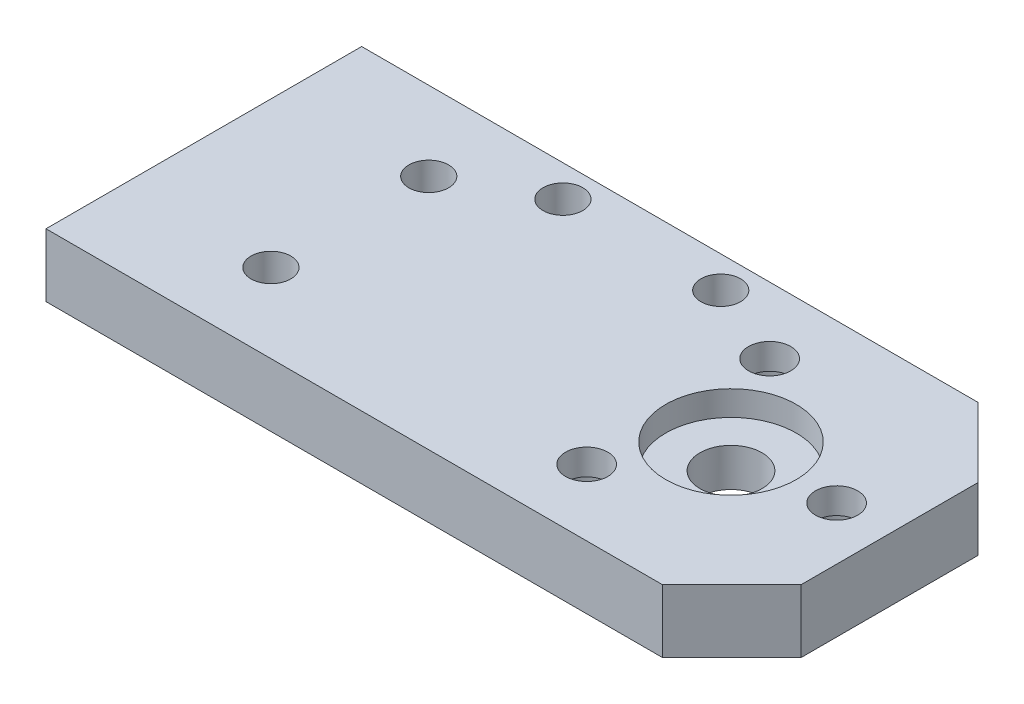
ISO-10303-21;
HEADER;
FILE_DESCRIPTION(('STEP AP214'),'2;1');
FILE_NAME('part.step','',(''),(''),'','','');
FILE_SCHEMA(('AUTOMOTIVE_DESIGN { 1 0 10303 214 1 1 1 1 }'));
ENDSEC;
DATA;
#1=APPLICATION_CONTEXT('core data for automotive mechanical design processes');
#2=APPLICATION_PROTOCOL_DEFINITION('international standard','automotive_design',2000,#1);
#3=PRODUCT_CONTEXT('',#1,'mechanical');
#4=PRODUCT('Part','Part','',(#3));
#5=PRODUCT_RELATED_PRODUCT_CATEGORY('part','',(#4));
#6=PRODUCT_DEFINITION_FORMATION('','',#4);
#7=PRODUCT_DEFINITION_CONTEXT('part definition',#1,'design');
#8=PRODUCT_DEFINITION('design','',#6,#7);
#9=PRODUCT_DEFINITION_SHAPE('','',#8);
#10=(LENGTH_UNIT() NAMED_UNIT(*) SI_UNIT(.MILLI.,.METRE.));
#11=(NAMED_UNIT(*) PLANE_ANGLE_UNIT() SI_UNIT($,.RADIAN.));
#12=(NAMED_UNIT(*) SI_UNIT($,.STERADIAN.) SOLID_ANGLE_UNIT());
#13=UNCERTAINTY_MEASURE_WITH_UNIT(LENGTH_MEASURE(1.E-05),#10,'distance_accuracy_value','');
#14=(GEOMETRIC_REPRESENTATION_CONTEXT(3) GLOBAL_UNCERTAINTY_ASSIGNED_CONTEXT((#13)) GLOBAL_UNIT_ASSIGNED_CONTEXT((#10,
#11,#12)) REPRESENTATION_CONTEXT('',''));
#15=CARTESIAN_POINT('',(0.,0.,0.));
#16=DIRECTION('',(0.,0.,1.));
#17=DIRECTION('',(1.,0.,0.));
#18=AXIS2_PLACEMENT_3D('',#15,#16,#17);
#19=CARTESIAN_POINT('',(42.4175,-0.92,-12.7));
#20=DIRECTION('',(0.,1.,0.));
#21=DIRECTION('',(0.,0.,1.));
#22=AXIS2_PLACEMENT_3D('',#19,#20,#21);
#23=CYLINDRICAL_SURFACE('',#22,2.5);
#24=CARTESIAN_POINT('',(42.4175,0.,-12.7));
#25=DIRECTION('',(0.,-1.,0.));
#26=DIRECTION('',(0.,0.,-1.));
#27=AXIS2_PLACEMENT_3D('',#24,#25,#26);
#28=CIRCLE('',#27,2.5);
#29=CARTESIAN_POINT('',(42.4175,0.,-15.2));
#30=VERTEX_POINT('',#29);
#31=EDGE_CURVE('E122',#30,#30,#28,.T.);
#32=ORIENTED_EDGE('',*,*,#31,.T.);
#33=EDGE_LOOP('',(#32));
#34=FACE_BOUND('',#33,.T.);
#35=CARTESIAN_POINT('',(42.4175,3.08,-12.7));
#36=DIRECTION('',(0.,1.,0.));
#37=DIRECTION('',(0.,0.,1.));
#38=AXIS2_PLACEMENT_3D('',#35,#36,#37);
#39=CIRCLE('',#38,2.5);
#40=CARTESIAN_POINT('',(42.4175,3.08,-10.2));
#41=VERTEX_POINT('',#40);
#42=EDGE_CURVE('E125',#41,#41,#39,.F.);
#43=ORIENTED_EDGE('',*,*,#42,.F.);
#44=EDGE_LOOP('',(#43));
#45=FACE_BOUND('',#44,.T.);
#46=ADVANCED_FACE('F38',(#34,#45),#23,.F.);
#47=CARTESIAN_POINT('',(0.,5.08,0.));
#48=DIRECTION('',(1.,0.,0.));
#49=DIRECTION('',(0.,0.,-1.));
#50=AXIS2_PLACEMENT_3D('',#47,#48,#49);
#51=PLANE('',#50);
#52=DIRECTION('',(0.,0.,1.));
#53=VECTOR('',#52,1.);
#54=CARTESIAN_POINT('',(0.,0.,0.));
#55=LINE('',#54,#53);
#56=CARTESIAN_POINT('',(0.,0.,-25.4));
#57=VERTEX_POINT('',#56);
#58=CARTESIAN_POINT('',(0.,0.,0.));
#59=VERTEX_POINT('',#58);
#60=EDGE_CURVE('E113',#57,#59,#55,.T.);
#61=ORIENTED_EDGE('',*,*,#60,.T.);
#62=DIRECTION('',(0.,-1.,0.));
#63=VECTOR('',#62,1.);
#64=CARTESIAN_POINT('',(0.,5.08,0.));
#65=LINE('',#64,#63);
#66=CARTESIAN_POINT('',(0.,5.08,0.));
#67=VERTEX_POINT('',#66);
#68=EDGE_CURVE('E96',#67,#59,#65,.T.);
#69=ORIENTED_EDGE('',*,*,#68,.F.);
#70=DIRECTION('',(0.,0.,1.));
#71=VECTOR('',#70,1.);
#72=CARTESIAN_POINT('',(0.,5.08,0.));
#73=LINE('',#72,#71);
#74=CARTESIAN_POINT('',(0.,5.08,-25.4));
#75=VERTEX_POINT('',#74);
#76=EDGE_CURVE('E101',#75,#67,#73,.T.);
#77=ORIENTED_EDGE('',*,*,#76,.F.);
#78=DIRECTION('',(0.,-1.,0.));
#79=VECTOR('',#78,1.);
#80=CARTESIAN_POINT('',(0.,5.08,-25.4));
#81=LINE('',#80,#79);
#82=EDGE_CURVE('E115',#75,#57,#81,.T.);
#83=ORIENTED_EDGE('',*,*,#82,.T.);
#84=EDGE_LOOP('',(#61,#69,#77,#83));
#85=FACE_BOUND('',#84,.T.);
#86=ADVANCED_FACE('F111',(#85),#51,.F.);
#87=CARTESIAN_POINT('',(0.,5.08,0.));
#88=DIRECTION('',(0.,0.,-1.));
#89=DIRECTION('',(-1.,0.,0.));
#90=AXIS2_PLACEMENT_3D('',#87,#88,#89);
#91=PLANE('',#90);
#92=DIRECTION('',(1.,0.,0.));
#93=VECTOR('',#92,1.);
#94=CARTESIAN_POINT('',(0.,0.,0.));
#95=LINE('',#94,#93);
#96=CARTESIAN_POINT('',(49.5935,0.,0.));
#97=VERTEX_POINT('',#96);
#98=EDGE_CURVE('E164',#59,#97,#95,.T.);
#99=ORIENTED_EDGE('',*,*,#98,.T.);
#100=DIRECTION('',(0.,1.,0.));
#101=VECTOR('',#100,1.);
#102=CARTESIAN_POINT('',(49.5935,5.08,0.));
#103=LINE('',#102,#101);
#104=CARTESIAN_POINT('',(49.5935,5.08,0.));
#105=VERTEX_POINT('',#104);
#106=EDGE_CURVE('E62',#97,#105,#103,.T.);
#107=ORIENTED_EDGE('',*,*,#106,.T.);
#108=DIRECTION('',(1.,0.,0.));
#109=VECTOR('',#108,1.);
#110=CARTESIAN_POINT('',(0.,5.08,0.));
#111=LINE('',#110,#109);
#112=EDGE_CURVE('E92',#67,#105,#111,.T.);
#113=ORIENTED_EDGE('',*,*,#112,.F.);
#114=ORIENTED_EDGE('',*,*,#68,.T.);
#115=EDGE_LOOP('',(#99,#107,#113,#114));
#116=FACE_BOUND('',#115,.T.);
#117=ADVANCED_FACE('F94',(#116),#91,.F.);
#118=CARTESIAN_POINT('',(55.1815,5.08,0.));
#119=DIRECTION('',(-1.,0.,0.));
#120=DIRECTION('',(0.,0.,1.));
#121=AXIS2_PLACEMENT_3D('',#118,#119,#120);
#122=PLANE('',#121);
#123=DIRECTION('',(0.,0.,-1.));
#124=VECTOR('',#123,1.);
#125=CARTESIAN_POINT('',(55.1815,5.08,0.));
#126=LINE('',#125,#124);
#127=CARTESIAN_POINT('',(55.1815,5.08,-5.58800000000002));
#128=VERTEX_POINT('',#127);
#129=CARTESIAN_POINT('',(55.1815,5.08,-19.812));
#130=VERTEX_POINT('',#129);
#131=EDGE_CURVE('E100',#128,#130,#126,.T.);
#132=ORIENTED_EDGE('',*,*,#131,.F.);
#133=DIRECTION('',(0.,-1.,0.));
#134=VECTOR('',#133,1.);
#135=CARTESIAN_POINT('',(55.1815,5.08,-5.58800000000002));
#136=LINE('',#135,#134);
#137=CARTESIAN_POINT('',(55.1815,0.,-5.58800000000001));
#138=VERTEX_POINT('',#137);
#139=EDGE_CURVE('E117',#128,#138,#136,.T.);
#140=ORIENTED_EDGE('',*,*,#139,.T.);
#141=DIRECTION('',(0.,0.,-1.));
#142=VECTOR('',#141,1.);
#143=CARTESIAN_POINT('',(55.1815,0.,0.));
#144=LINE('',#143,#142);
#145=CARTESIAN_POINT('',(55.1815,0.,-19.812));
#146=VERTEX_POINT('',#145);
#147=EDGE_CURVE('E165',#138,#146,#144,.T.);
#148=ORIENTED_EDGE('',*,*,#147,.T.);
#149=DIRECTION('',(0.,1.,0.));
#150=VECTOR('',#149,1.);
#151=CARTESIAN_POINT('',(55.1815,5.08,-19.812));
#152=LINE('',#151,#150);
#153=EDGE_CURVE('E114',#146,#130,#152,.T.);
#154=ORIENTED_EDGE('',*,*,#153,.T.);
#155=EDGE_LOOP('',(#132,#140,#148,#154));
#156=FACE_BOUND('',#155,.T.);
#157=ADVANCED_FACE('F156',(#156),#122,.F.);
#158=CARTESIAN_POINT('',(0.,5.08,-25.4));
#159=DIRECTION('',(0.,0.,1.));
#160=DIRECTION('',(1.,0.,0.));
#161=AXIS2_PLACEMENT_3D('',#158,#159,#160);
#162=PLANE('',#161);
#163=DIRECTION('',(-1.,0.,0.));
#164=VECTOR('',#163,1.);
#165=CARTESIAN_POINT('',(0.,5.08,-25.4));
#166=LINE('',#165,#164);
#167=CARTESIAN_POINT('',(49.5935,5.08,-25.4));
#168=VERTEX_POINT('',#167);
#169=EDGE_CURVE('E105',#168,#75,#166,.T.);
#170=ORIENTED_EDGE('',*,*,#169,.F.);
#171=DIRECTION('',(0.,-1.,0.));
#172=VECTOR('',#171,1.);
#173=CARTESIAN_POINT('',(49.5935,5.08,-25.4));
#174=LINE('',#173,#172);
#175=CARTESIAN_POINT('',(49.5935,0.,-25.4));
#176=VERTEX_POINT('',#175);
#177=EDGE_CURVE('E11',#168,#176,#174,.T.);
#178=ORIENTED_EDGE('',*,*,#177,.T.);
#179=DIRECTION('',(-1.,0.,0.));
#180=VECTOR('',#179,1.);
#181=CARTESIAN_POINT('',(0.,0.,-25.4));
#182=LINE('',#181,#180);
#183=EDGE_CURVE('E109',#176,#57,#182,.T.);
#184=ORIENTED_EDGE('',*,*,#183,.T.);
#185=ORIENTED_EDGE('',*,*,#82,.F.);
#186=EDGE_LOOP('',(#170,#178,#184,#185));
#187=FACE_BOUND('',#186,.T.);
#188=ADVANCED_FACE('F175',(#187),#162,.F.);
#189=CARTESIAN_POINT('',(0.,5.08,0.));
#190=DIRECTION('',(0.,-1.,0.));
#191=DIRECTION('',(0.,0.,-1.));
#192=AXIS2_PLACEMENT_3D('',#189,#190,#191);
#193=PLANE('',#192);
#194=CARTESIAN_POINT('',(31.4325,5.08,-22.86));
#195=DIRECTION('',(0.,1.,0.));
#196=DIRECTION('',(0.,0.,1.));
#197=AXIS2_PLACEMENT_3D('',#194,#195,#196);
#198=CIRCLE('',#197,1.6);
#199=CARTESIAN_POINT('',(31.4325,5.08,-21.26));
#200=VERTEX_POINT('',#199);
#201=EDGE_CURVE('E374',#200,#200,#198,.T.);
#202=ORIENTED_EDGE('',*,*,#201,.F.);
#203=EDGE_LOOP('',(#202));
#204=FACE_BOUND('',#203,.T.);
#205=CARTESIAN_POINT('',(18.7325,5.08,-22.86));
#206=DIRECTION('',(0.,1.,0.));
#207=DIRECTION('',(0.,0.,1.));
#208=AXIS2_PLACEMENT_3D('',#205,#206,#207);
#209=CIRCLE('',#208,1.6);
#210=CARTESIAN_POINT('',(18.7325,5.08,-21.26));
#211=VERTEX_POINT('',#210);
#212=EDGE_CURVE('E376',#211,#211,#209,.T.);
#213=ORIENTED_EDGE('',*,*,#212,.F.);
#214=EDGE_LOOP('',(#213));
#215=FACE_BOUND('',#214,.T.);
#216=CARTESIAN_POINT('',(11.7475,5.08,-19.05));
#217=DIRECTION('',(0.,1.,0.));
#218=DIRECTION('',(0.,0.,1.));
#219=AXIS2_PLACEMENT_3D('',#216,#217,#218);
#220=CIRCLE('',#219,1.6);
#221=CARTESIAN_POINT('',(11.7475,5.08,-17.45));
#222=VERTEX_POINT('',#221);
#223=EDGE_CURVE('E383',#222,#222,#220,.T.);
#224=ORIENTED_EDGE('',*,*,#223,.F.);
#225=EDGE_LOOP('',(#224));
#226=FACE_BOUND('',#225,.T.);
#227=CARTESIAN_POINT('',(11.7475,5.08,-6.35));
#228=DIRECTION('',(0.,1.,0.));
#229=DIRECTION('',(0.,0.,1.));
#230=AXIS2_PLACEMENT_3D('',#227,#228,#229);
#231=CIRCLE('',#230,1.6);
#232=CARTESIAN_POINT('',(11.7475,5.08,-4.75));
#233=VERTEX_POINT('',#232);
#234=EDGE_CURVE('E389',#233,#233,#231,.T.);
#235=ORIENTED_EDGE('',*,*,#234,.F.);
#236=EDGE_LOOP('',(#235));
#237=FACE_BOUND('',#236,.T.);
#238=CARTESIAN_POINT('',(50.9175,5.08,-12.7));
#239=DIRECTION('',(0.,-1.,0.));
#240=DIRECTION('',(0.,0.,-1.));
#241=AXIS2_PLACEMENT_3D('',#238,#239,#240);
#242=CIRCLE('',#241,1.7);
#243=CARTESIAN_POINT('',(50.9175,5.08,-14.4));
#244=VERTEX_POINT('',#243);
#245=EDGE_CURVE('E139',#244,#244,#242,.T.);
#246=ORIENTED_EDGE('',*,*,#245,.T.);
#247=EDGE_LOOP('',(#246));
#248=FACE_BOUND('',#247,.T.);
#249=CARTESIAN_POINT('',(38.1675,5.08,-5.33878406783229));
#250=DIRECTION('',(0.,-1.,0.));
#251=DIRECTION('',(0.,0.,-1.));
#252=AXIS2_PLACEMENT_3D('',#249,#250,#251);
#253=CIRCLE('',#252,1.7);
#254=CARTESIAN_POINT('',(38.1675,5.08,-7.03878406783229));
#255=VERTEX_POINT('',#254);
#256=EDGE_CURVE('E134',#255,#255,#253,.T.);
#257=ORIENTED_EDGE('',*,*,#256,.T.);
#258=EDGE_LOOP('',(#257));
#259=FACE_BOUND('',#258,.T.);
#260=CARTESIAN_POINT('',(38.1675,5.08,-20.0612159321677));
#261=DIRECTION('',(0.,-1.,0.));
#262=DIRECTION('',(0.,0.,-1.));
#263=AXIS2_PLACEMENT_3D('',#260,#261,#262);
#264=CIRCLE('',#263,1.7);
#265=CARTESIAN_POINT('',(38.1675,5.08,-21.7612159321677));
#266=VERTEX_POINT('',#265);
#267=EDGE_CURVE('E129',#266,#266,#264,.T.);
#268=ORIENTED_EDGE('',*,*,#267,.T.);
#269=EDGE_LOOP('',(#268));
#270=FACE_BOUND('',#269,.T.);
#271=CARTESIAN_POINT('',(42.4175,5.08,-12.7));
#272=DIRECTION('',(0.,1.,0.));
#273=DIRECTION('',(0.,0.,1.));
#274=AXIS2_PLACEMENT_3D('',#271,#272,#273);
#275=CIRCLE('',#274,5.25);
#276=CARTESIAN_POINT('',(42.4175,5.08,-7.45));
#277=VERTEX_POINT('',#276);
#278=EDGE_CURVE('E132',#277,#277,#275,.T.);
#279=ORIENTED_EDGE('',*,*,#278,.F.);
#280=EDGE_LOOP('',(#279));
#281=FACE_BOUND('',#280,.T.);
#282=ORIENTED_EDGE('',*,*,#112,.T.);
#283=DIRECTION('',(-0.707106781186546,0.,0.707106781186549));
#284=VECTOR('',#283,1.);
#285=CARTESIAN_POINT('',(55.1815,5.08,-5.58800000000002));
#286=LINE('',#285,#284);
#287=EDGE_CURVE('E47',#105,#128,#286,.F.);
#288=ORIENTED_EDGE('',*,*,#287,.T.);
#289=ORIENTED_EDGE('',*,*,#131,.T.);
#290=DIRECTION('',(0.707106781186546,0.,0.707106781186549));
#291=VECTOR('',#290,1.);
#292=CARTESIAN_POINT('',(49.5935,5.08,-25.4));
#293=LINE('',#292,#291);
#294=EDGE_CURVE('E54',#130,#168,#293,.F.);
#295=ORIENTED_EDGE('',*,*,#294,.T.);
#296=ORIENTED_EDGE('',*,*,#169,.T.);
#297=ORIENTED_EDGE('',*,*,#76,.T.);
#298=EDGE_LOOP('',(#282,#288,#289,#295,#296,#297));
#299=FACE_BOUND('',#298,.T.);
#300=ADVANCED_FACE('F104',(#204,#215,#226,#237,#248,#259,#270,#281,#299),#193,.F.);
#301=CARTESIAN_POINT('',(0.,0.,0.));
#302=DIRECTION('',(0.,-1.,0.));
#303=DIRECTION('',(0.,0.,-1.));
#304=AXIS2_PLACEMENT_3D('',#301,#302,#303);
#305=PLANE('',#304);
#306=CARTESIAN_POINT('',(31.4325,0.,-22.86));
#307=DIRECTION('',(0.,-1.,0.));
#308=DIRECTION('',(0.,0.,-1.));
#309=AXIS2_PLACEMENT_3D('',#306,#307,#308);
#310=CIRCLE('',#309,1.6);
#311=CARTESIAN_POINT('',(31.4325,0.,-24.46));
#312=VERTEX_POINT('',#311);
#313=EDGE_CURVE('E42',#312,#312,#310,.T.);
#314=ORIENTED_EDGE('',*,*,#313,.F.);
#315=EDGE_LOOP('',(#314));
#316=FACE_BOUND('',#315,.T.);
#317=CARTESIAN_POINT('',(18.7325,0.,-22.86));
#318=DIRECTION('',(0.,-1.,0.));
#319=DIRECTION('',(0.,0.,-1.));
#320=AXIS2_PLACEMENT_3D('',#317,#318,#319);
#321=CIRCLE('',#320,1.6);
#322=CARTESIAN_POINT('',(18.7325,0.,-24.46));
#323=VERTEX_POINT('',#322);
#324=EDGE_CURVE('E380',#323,#323,#321,.T.);
#325=ORIENTED_EDGE('',*,*,#324,.F.);
#326=EDGE_LOOP('',(#325));
#327=FACE_BOUND('',#326,.T.);
#328=CARTESIAN_POINT('',(11.7475,0.,-19.05));
#329=DIRECTION('',(0.,-1.,0.));
#330=DIRECTION('',(0.,0.,-1.));
#331=AXIS2_PLACEMENT_3D('',#328,#329,#330);
#332=CIRCLE('',#331,1.6);
#333=CARTESIAN_POINT('',(11.7475,0.,-20.65));
#334=VERTEX_POINT('',#333);
#335=EDGE_CURVE('E386',#334,#334,#332,.T.);
#336=ORIENTED_EDGE('',*,*,#335,.F.);
#337=EDGE_LOOP('',(#336));
#338=FACE_BOUND('',#337,.T.);
#339=CARTESIAN_POINT('',(11.7475,0.,-6.35));
#340=DIRECTION('',(0.,-1.,0.));
#341=DIRECTION('',(0.,0.,-1.));
#342=AXIS2_PLACEMENT_3D('',#339,#340,#341);
#343=CIRCLE('',#342,1.6);
#344=CARTESIAN_POINT('',(11.7475,0.,-7.95));
#345=VERTEX_POINT('',#344);
#346=EDGE_CURVE('E392',#345,#345,#343,.T.);
#347=ORIENTED_EDGE('',*,*,#346,.F.);
#348=EDGE_LOOP('',(#347));
#349=FACE_BOUND('',#348,.T.);
#350=CARTESIAN_POINT('',(50.9175,0.,-12.7));
#351=DIRECTION('',(0.,-1.,0.));
#352=DIRECTION('',(0.,0.,-1.));
#353=AXIS2_PLACEMENT_3D('',#350,#351,#352);
#354=CIRCLE('',#353,3.25);
#355=CARTESIAN_POINT('',(50.9175,0.,-15.95));
#356=VERTEX_POINT('',#355);
#357=EDGE_CURVE('E395',#356,#356,#354,.T.);
#358=ORIENTED_EDGE('',*,*,#357,.F.);
#359=EDGE_LOOP('',(#358));
#360=FACE_BOUND('',#359,.T.);
#361=CARTESIAN_POINT('',(38.1675,0.,-5.33878406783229));
#362=DIRECTION('',(0.,-1.,0.));
#363=DIRECTION('',(0.,0.,-1.));
#364=AXIS2_PLACEMENT_3D('',#361,#362,#363);
#365=CIRCLE('',#364,3.25);
#366=CARTESIAN_POINT('',(38.1675,0.,-8.58878406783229));
#367=VERTEX_POINT('',#366);
#368=EDGE_CURVE('E141',#367,#367,#365,.T.);
#369=ORIENTED_EDGE('',*,*,#368,.F.);
#370=EDGE_LOOP('',(#369));
#371=FACE_BOUND('',#370,.T.);
#372=CARTESIAN_POINT('',(38.1675,0.,-20.0612159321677));
#373=DIRECTION('',(0.,-1.,0.));
#374=DIRECTION('',(0.,0.,-1.));
#375=AXIS2_PLACEMENT_3D('',#372,#373,#374);
#376=CIRCLE('',#375,3.25);
#377=CARTESIAN_POINT('',(38.1675,0.,-23.3112159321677));
#378=VERTEX_POINT('',#377);
#379=EDGE_CURVE('E137',#378,#378,#376,.T.);
#380=ORIENTED_EDGE('',*,*,#379,.F.);
#381=EDGE_LOOP('',(#380));
#382=FACE_BOUND('',#381,.T.);
#383=ORIENTED_EDGE('',*,*,#31,.F.);
#384=EDGE_LOOP('',(#383));
#385=FACE_BOUND('',#384,.T.);
#386=ORIENTED_EDGE('',*,*,#147,.F.);
#387=DIRECTION('',(0.707106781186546,0.,-0.707106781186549));
#388=VECTOR('',#387,1.);
#389=CARTESIAN_POINT('',(24.7967500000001,0.,24.79675));
#390=LINE('',#389,#388);
#391=EDGE_CURVE('E148',#138,#97,#390,.F.);
#392=ORIENTED_EDGE('',*,*,#391,.T.);
#393=ORIENTED_EDGE('',*,*,#98,.F.);
#394=ORIENTED_EDGE('',*,*,#60,.F.);
#395=ORIENTED_EDGE('',*,*,#183,.F.);
#396=DIRECTION('',(-0.707106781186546,0.,-0.707106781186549));
#397=VECTOR('',#396,1.);
#398=CARTESIAN_POINT('',(37.4967500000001,0.,-37.49675));
#399=LINE('',#398,#397);
#400=EDGE_CURVE('E146',#176,#146,#399,.F.);
#401=ORIENTED_EDGE('',*,*,#400,.T.);
#402=EDGE_LOOP('',(#386,#392,#393,#394,#395,#401));
#403=FACE_BOUND('',#402,.T.);
#404=ADVANCED_FACE('F163',(#316,#327,#338,#349,#360,#371,#382,#385,#403),#305,.T.);
#405=CARTESIAN_POINT('',(42.4175,3.08,-12.7));
#406=DIRECTION('',(0.,1.,0.));
#407=DIRECTION('',(0.,0.,1.));
#408=AXIS2_PLACEMENT_3D('',#405,#406,#407);
#409=PLANE('',#408);
#410=CARTESIAN_POINT('',(42.4175,3.08,-12.7));
#411=DIRECTION('',(0.,1.,0.));
#412=DIRECTION('',(0.,0.,1.));
#413=AXIS2_PLACEMENT_3D('',#410,#411,#412);
#414=CIRCLE('',#413,5.25);
#415=CARTESIAN_POINT('',(42.4175,3.08,-7.45));
#416=VERTEX_POINT('',#415);
#417=EDGE_CURVE('E128',#416,#416,#414,.T.);
#418=ORIENTED_EDGE('',*,*,#417,.T.);
#419=EDGE_LOOP('',(#418));
#420=FACE_BOUND('',#419,.T.);
#421=ORIENTED_EDGE('',*,*,#42,.T.);
#422=EDGE_LOOP('',(#421));
#423=FACE_BOUND('',#422,.T.);
#424=ADVANCED_FACE('F205',(#420,#423),#409,.T.);
#425=CARTESIAN_POINT('',(42.4175,3.08,-12.7));
#426=DIRECTION('',(0.,1.,0.));
#427=DIRECTION('',(0.,0.,1.));
#428=AXIS2_PLACEMENT_3D('',#425,#426,#427);
#429=CYLINDRICAL_SURFACE('',#428,5.25);
#430=ORIENTED_EDGE('',*,*,#417,.F.);
#431=EDGE_LOOP('',(#430));
#432=FACE_BOUND('',#431,.T.);
#433=ORIENTED_EDGE('',*,*,#278,.T.);
#434=EDGE_LOOP('',(#433));
#435=FACE_BOUND('',#434,.T.);
#436=ADVANCED_FACE('F198',(#432,#435),#429,.F.);
#437=CARTESIAN_POINT('',(38.1675,0.,-20.0612159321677));
#438=DIRECTION('',(0.,-1.,0.));
#439=DIRECTION('',(0.,0.,-1.));
#440=AXIS2_PLACEMENT_3D('',#437,#438,#439);
#441=CYLINDRICAL_SURFACE('',#440,1.7);
#442=CARTESIAN_POINT('',(38.1675,3.,-20.0612159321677));
#443=DIRECTION('',(0.,-1.,0.));
#444=DIRECTION('',(0.,0.,-1.));
#445=AXIS2_PLACEMENT_3D('',#442,#443,#444);
#446=CIRCLE('',#445,1.7);
#447=CARTESIAN_POINT('',(38.1675,3.,-21.7612159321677));
#448=VERTEX_POINT('',#447);
#449=EDGE_CURVE('E133',#448,#448,#446,.T.);
#450=ORIENTED_EDGE('',*,*,#449,.T.);
#451=EDGE_LOOP('',(#450));
#452=FACE_BOUND('',#451,.T.);
#453=ORIENTED_EDGE('',*,*,#267,.F.);
#454=EDGE_LOOP('',(#453));
#455=FACE_BOUND('',#454,.T.);
#456=ADVANCED_FACE('F244',(#452,#455),#441,.F.);
#457=CARTESIAN_POINT('',(39.8675,3.,-20.0612159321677));
#458=DIRECTION('',(0.,1.,0.));
#459=DIRECTION('',(0.,0.,1.));
#460=AXIS2_PLACEMENT_3D('',#457,#458,#459);
#461=PLANE('',#460);
#462=ORIENTED_EDGE('',*,*,#449,.F.);
#463=EDGE_LOOP('',(#462));
#464=FACE_BOUND('',#463,.T.);
#465=CARTESIAN_POINT('',(38.1675,3.,-20.0612159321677));
#466=DIRECTION('',(0.,-1.,0.));
#467=DIRECTION('',(0.,0.,-1.));
#468=AXIS2_PLACEMENT_3D('',#465,#466,#467);
#469=CIRCLE('',#468,3.25);
#470=CARTESIAN_POINT('',(38.1675,3.,-23.3112159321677));
#471=VERTEX_POINT('',#470);
#472=EDGE_CURVE('E412',#471,#471,#469,.T.);
#473=ORIENTED_EDGE('',*,*,#472,.T.);
#474=EDGE_LOOP('',(#473));
#475=FACE_BOUND('',#474,.T.);
#476=ADVANCED_FACE('F251',(#464,#475),#461,.F.);
#477=CARTESIAN_POINT('',(38.1675,0.,-20.0612159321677));
#478=DIRECTION('',(0.,-1.,0.));
#479=DIRECTION('',(0.,0.,-1.));
#480=AXIS2_PLACEMENT_3D('',#477,#478,#479);
#481=CYLINDRICAL_SURFACE('',#480,3.25);
#482=ORIENTED_EDGE('',*,*,#472,.F.);
#483=EDGE_LOOP('',(#482));
#484=FACE_BOUND('',#483,.T.);
#485=ORIENTED_EDGE('',*,*,#379,.T.);
#486=EDGE_LOOP('',(#485));
#487=FACE_BOUND('',#486,.T.);
#488=ADVANCED_FACE('F259',(#484,#487),#481,.F.);
#489=CARTESIAN_POINT('',(38.1675,0.,-5.33878406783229));
#490=DIRECTION('',(0.,-1.,0.));
#491=DIRECTION('',(0.,0.,-1.));
#492=AXIS2_PLACEMENT_3D('',#489,#490,#491);
#493=CYLINDRICAL_SURFACE('',#492,1.7);
#494=CARTESIAN_POINT('',(38.1675,3.,-5.33878406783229));
#495=DIRECTION('',(0.,-1.,0.));
#496=DIRECTION('',(0.,0.,-1.));
#497=AXIS2_PLACEMENT_3D('',#494,#495,#496);
#498=CIRCLE('',#497,1.7);
#499=CARTESIAN_POINT('',(38.1675,3.,-7.03878406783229));
#500=VERTEX_POINT('',#499);
#501=EDGE_CURVE('E138',#500,#500,#498,.T.);
#502=ORIENTED_EDGE('',*,*,#501,.T.);
#503=EDGE_LOOP('',(#502));
#504=FACE_BOUND('',#503,.T.);
#505=ORIENTED_EDGE('',*,*,#256,.F.);
#506=EDGE_LOOP('',(#505));
#507=FACE_BOUND('',#506,.T.);
#508=ADVANCED_FACE('F267',(#504,#507),#493,.F.);
#509=CARTESIAN_POINT('',(39.8675,3.,-5.33878406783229));
#510=DIRECTION('',(0.,1.,0.));
#511=DIRECTION('',(0.,0.,1.));
#512=AXIS2_PLACEMENT_3D('',#509,#510,#511);
#513=PLANE('',#512);
#514=ORIENTED_EDGE('',*,*,#501,.F.);
#515=EDGE_LOOP('',(#514));
#516=FACE_BOUND('',#515,.T.);
#517=CARTESIAN_POINT('',(38.1675,3.,-5.33878406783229));
#518=DIRECTION('',(0.,-1.,0.));
#519=DIRECTION('',(0.,0.,-1.));
#520=AXIS2_PLACEMENT_3D('',#517,#518,#519);
#521=CIRCLE('',#520,3.25);
#522=CARTESIAN_POINT('',(38.1675,3.,-8.58878406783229));
#523=VERTEX_POINT('',#522);
#524=EDGE_CURVE('E405',#523,#523,#521,.T.);
#525=ORIENTED_EDGE('',*,*,#524,.T.);
#526=EDGE_LOOP('',(#525));
#527=FACE_BOUND('',#526,.T.);
#528=ADVANCED_FACE('F275',(#516,#527),#513,.F.);
#529=CARTESIAN_POINT('',(38.1675,0.,-5.33878406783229));
#530=DIRECTION('',(0.,-1.,0.));
#531=DIRECTION('',(0.,0.,-1.));
#532=AXIS2_PLACEMENT_3D('',#529,#530,#531);
#533=CYLINDRICAL_SURFACE('',#532,3.25);
#534=ORIENTED_EDGE('',*,*,#524,.F.);
#535=EDGE_LOOP('',(#534));
#536=FACE_BOUND('',#535,.T.);
#537=ORIENTED_EDGE('',*,*,#368,.T.);
#538=EDGE_LOOP('',(#537));
#539=FACE_BOUND('',#538,.T.);
#540=ADVANCED_FACE('F283',(#536,#539),#533,.F.);
#541=CARTESIAN_POINT('',(50.9175,0.,-12.7));
#542=DIRECTION('',(0.,-1.,0.));
#543=DIRECTION('',(0.,0.,-1.));
#544=AXIS2_PLACEMENT_3D('',#541,#542,#543);
#545=CYLINDRICAL_SURFACE('',#544,1.7);
#546=CARTESIAN_POINT('',(50.9175,3.,-12.7));
#547=DIRECTION('',(0.,-1.,0.));
#548=DIRECTION('',(0.,0.,-1.));
#549=AXIS2_PLACEMENT_3D('',#546,#547,#548);
#550=CIRCLE('',#549,1.7);
#551=CARTESIAN_POINT('',(50.9175,3.,-14.4));
#552=VERTEX_POINT('',#551);
#553=EDGE_CURVE('E142',#552,#552,#550,.T.);
#554=ORIENTED_EDGE('',*,*,#553,.T.);
#555=EDGE_LOOP('',(#554));
#556=FACE_BOUND('',#555,.T.);
#557=ORIENTED_EDGE('',*,*,#245,.F.);
#558=EDGE_LOOP('',(#557));
#559=FACE_BOUND('',#558,.T.);
#560=ADVANCED_FACE('F291',(#556,#559),#545,.F.);
#561=CARTESIAN_POINT('',(52.6175,3.,-12.7));
#562=DIRECTION('',(0.,1.,0.));
#563=DIRECTION('',(0.,0.,1.));
#564=AXIS2_PLACEMENT_3D('',#561,#562,#563);
#565=PLANE('',#564);
#566=ORIENTED_EDGE('',*,*,#553,.F.);
#567=EDGE_LOOP('',(#566));
#568=FACE_BOUND('',#567,.T.);
#569=CARTESIAN_POINT('',(50.9175,3.,-12.7));
#570=DIRECTION('',(0.,-1.,0.));
#571=DIRECTION('',(0.,0.,-1.));
#572=AXIS2_PLACEMENT_3D('',#569,#570,#571);
#573=CIRCLE('',#572,3.25);
#574=CARTESIAN_POINT('',(50.9175,3.,-15.95));
#575=VERTEX_POINT('',#574);
#576=EDGE_CURVE('E398',#575,#575,#573,.T.);
#577=ORIENTED_EDGE('',*,*,#576,.T.);
#578=EDGE_LOOP('',(#577));
#579=FACE_BOUND('',#578,.T.);
#580=ADVANCED_FACE('F299',(#568,#579),#565,.F.);
#581=CARTESIAN_POINT('',(50.9175,0.,-12.7));
#582=DIRECTION('',(0.,-1.,0.));
#583=DIRECTION('',(0.,0.,-1.));
#584=AXIS2_PLACEMENT_3D('',#581,#582,#583);
#585=CYLINDRICAL_SURFACE('',#584,3.25);
#586=ORIENTED_EDGE('',*,*,#576,.F.);
#587=EDGE_LOOP('',(#586));
#588=FACE_BOUND('',#587,.T.);
#589=ORIENTED_EDGE('',*,*,#357,.T.);
#590=EDGE_LOOP('',(#589));
#591=FACE_BOUND('',#590,.T.);
#592=ADVANCED_FACE('F187',(#588,#591),#585,.F.);
#593=CARTESIAN_POINT('',(55.1815,5.08,-5.58800000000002));
#594=DIRECTION('',(-0.707106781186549,0.,-0.707106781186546));
#595=DIRECTION('',(0.,-1.,0.));
#596=AXIS2_PLACEMENT_3D('',#593,#594,#595);
#597=PLANE('',#596);
#598=ORIENTED_EDGE('',*,*,#287,.F.);
#599=ORIENTED_EDGE('',*,*,#106,.F.);
#600=ORIENTED_EDGE('',*,*,#391,.F.);
#601=ORIENTED_EDGE('',*,*,#139,.F.);
#602=EDGE_LOOP('',(#598,#599,#600,#601));
#603=FACE_BOUND('',#602,.T.);
#604=ADVANCED_FACE('F161',(#603),#597,.F.);
#605=CARTESIAN_POINT('',(49.5935,5.08,-25.4));
#606=DIRECTION('',(-0.707106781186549,0.,0.707106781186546));
#607=DIRECTION('',(0.,-1.,0.));
#608=AXIS2_PLACEMENT_3D('',#605,#606,#607);
#609=PLANE('',#608);
#610=ORIENTED_EDGE('',*,*,#294,.F.);
#611=ORIENTED_EDGE('',*,*,#153,.F.);
#612=ORIENTED_EDGE('',*,*,#400,.F.);
#613=ORIENTED_EDGE('',*,*,#177,.F.);
#614=EDGE_LOOP('',(#610,#611,#612,#613));
#615=FACE_BOUND('',#614,.T.);
#616=ADVANCED_FACE('F40',(#615),#609,.F.);
#617=CARTESIAN_POINT('',(11.7475,5.08,-6.35));
#618=DIRECTION('',(0.,1.,0.));
#619=DIRECTION('',(0.,0.,1.));
#620=AXIS2_PLACEMENT_3D('',#617,#618,#619);
#621=CYLINDRICAL_SURFACE('',#620,1.6);
#622=ORIENTED_EDGE('',*,*,#346,.T.);
#623=EDGE_LOOP('',(#622));
#624=FACE_BOUND('',#623,.T.);
#625=ORIENTED_EDGE('',*,*,#234,.T.);
#626=EDGE_LOOP('',(#625));
#627=FACE_BOUND('',#626,.T.);
#628=ADVANCED_FACE('F179',(#624,#627),#621,.F.);
#629=CARTESIAN_POINT('',(11.7475,5.08,-19.05));
#630=DIRECTION('',(0.,1.,0.));
#631=DIRECTION('',(0.,0.,1.));
#632=AXIS2_PLACEMENT_3D('',#629,#630,#631);
#633=CYLINDRICAL_SURFACE('',#632,1.6);
#634=ORIENTED_EDGE('',*,*,#335,.T.);
#635=EDGE_LOOP('',(#634));
#636=FACE_BOUND('',#635,.T.);
#637=ORIENTED_EDGE('',*,*,#223,.T.);
#638=EDGE_LOOP('',(#637));
#639=FACE_BOUND('',#638,.T.);
#640=ADVANCED_FACE('F184',(#636,#639),#633,.F.);
#641=CARTESIAN_POINT('',(18.7325,5.08,-22.86));
#642=DIRECTION('',(0.,1.,0.));
#643=DIRECTION('',(0.,0.,1.));
#644=AXIS2_PLACEMENT_3D('',#641,#642,#643);
#645=CYLINDRICAL_SURFACE('',#644,1.6);
#646=ORIENTED_EDGE('',*,*,#324,.T.);
#647=EDGE_LOOP('',(#646));
#648=FACE_BOUND('',#647,.T.);
#649=ORIENTED_EDGE('',*,*,#212,.T.);
#650=EDGE_LOOP('',(#649));
#651=FACE_BOUND('',#650,.T.);
#652=ADVANCED_FACE('F345',(#648,#651),#645,.F.);
#653=CARTESIAN_POINT('',(31.4325,5.08,-22.86));
#654=DIRECTION('',(0.,1.,0.));
#655=DIRECTION('',(0.,0.,1.));
#656=AXIS2_PLACEMENT_3D('',#653,#654,#655);
#657=CYLINDRICAL_SURFACE('',#656,1.6);
#658=ORIENTED_EDGE('',*,*,#313,.T.);
#659=EDGE_LOOP('',(#658));
#660=FACE_BOUND('',#659,.T.);
#661=ORIENTED_EDGE('',*,*,#201,.T.);
#662=EDGE_LOOP('',(#661));
#663=FACE_BOUND('',#662,.T.);
#664=ADVANCED_FACE('F355',(#660,#663),#657,.F.);
#665=CLOSED_SHELL('',(#46,#86,#117,#157,#188,#300,#404,#424,#436,#456,#476,#488,#508,#528,#540,
#560,#580,#592,#604,#616,#628,#640,#652,#664));
#666=MANIFOLD_SOLID_BREP('B2',#665);
#667=ADVANCED_BREP_SHAPE_REPRESENTATION('',(#18,#666),#14);
#668=SHAPE_DEFINITION_REPRESENTATION(#9,#667);
ENDSEC;
END-ISO-10303-21;
